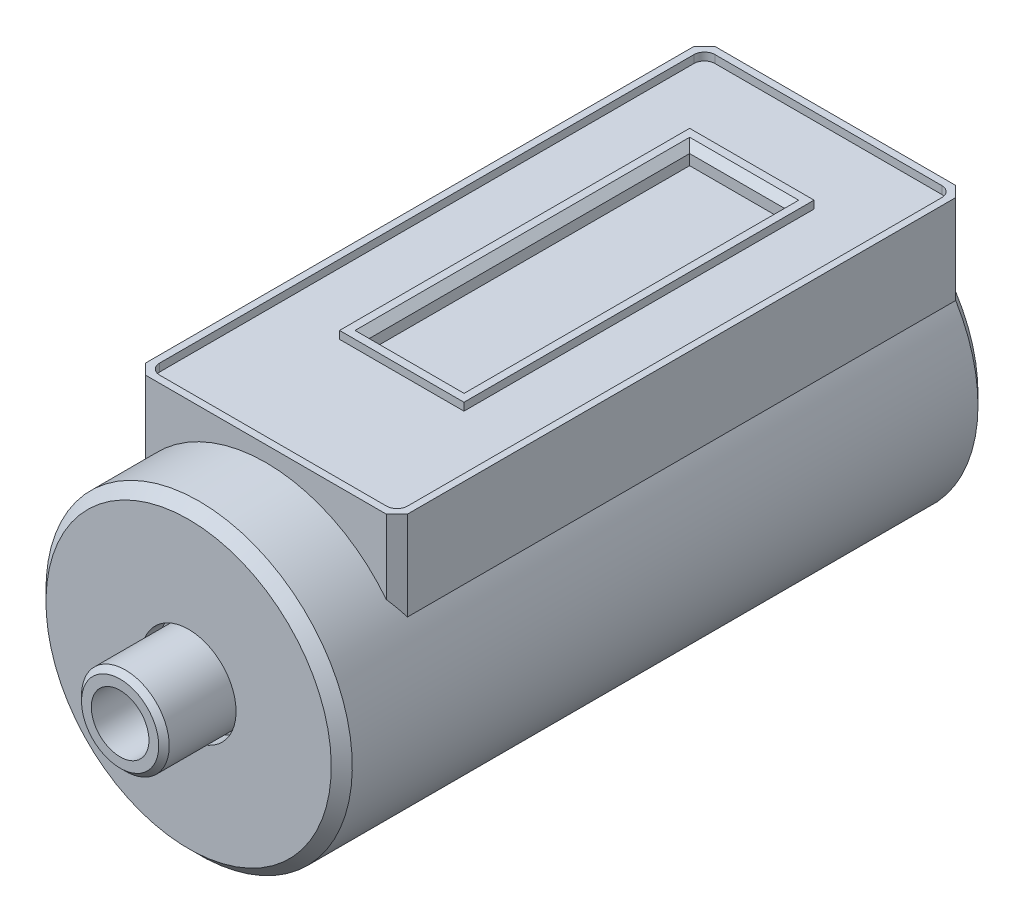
from build123d import *

# Parameters (mm, degrees)
EXTRUDE1_DEPTH     = 12.19
CHAMFER1_SIZE      = 0.76
SKETCH4_W          = 8.99
SKETCH4_H          = 25.3
CUT_EXTRUDE1_DEPTH = 0.56
SKETCH5_W          = 6.86
SKETCH5_H          = 23.16
CUT_EXTRUDE2_DEPTH = 1.27
CHAMFER2_SIZE      = 0.51
HOLE1_D            = 4.1656
HOLE1_DEPTH        = 6.35
HOLE1_TIP          = 1.251472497


with BuildPart() as part:
    # Sketch2 → Revolve1 (revolve)
    with BuildSketch(Plane(origin=(0, 0, 0), x_dir=(0, 0, -1), z_dir=(1, 0, 0))):
        Polygon((46.735, 0), (46.735, 2.79), (47.115, 3.17), (52.955, 3.17), (52.955, 3.43), (51.685, 3.43), (51.685, 10.31), (52.445, 11.07), (98.425, 11.07), (98.425, 0), align=None)
    revolve(axis=Axis((0, 0, -98.425), (0, 0, 1)))

    # Sketch3 → Extrude1 (add)
    with BuildSketch(Plane(origin=(0, 0, 0), x_dir=(1, 0, 0), z_dir=(0, 1, 0))):
        Polygon((-9.46, 98.425), (9.46, 98.425), (9.46, 58.035), (8.7, 57.275), (-8.7, 57.275), (-9.46, 58.035), align=None)
    extrude(amount=EXTRUDE1_DEPTH)

    # Chamfer1
    chamfer1_edges = [part.edges().sort_by_distance(p)[0] for p in [
        (-9.46, 8.969599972, -98.425),
        (9.46, 8.969599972, -98.425),
        (0, -11.07, -98.425),
    ]]
    chamfer(chamfer1_edges, length=CHAMFER1_SIZE)

    # Sketch4 → Cut-Extrude1 (cut)
    with BuildSketch(Plane(origin=(0, 12.19, 0), x_dir=(1, 0, 0), z_dir=(0, 1, 0))):
        with BuildLine():
            Line((-8.19, 97.915), (8.2, 97.915))
            ThreePointArc((8.2, 97.915), (8.737401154, 97.692401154), (8.96, 97.155))
            Line((8.96, 97.155), (8.96, 58.545))
            ThreePointArc((8.96, 58.545), (8.737401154, 58.007598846), (8.2, 57.785))
            Line((8.2, 57.785), (-8.19, 57.785))
            ThreePointArc((-8.19, 57.785), (-8.727401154, 58.007598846), (-8.95, 58.545))
            Line((-8.95, 58.545), (-8.95, 97.155))
            ThreePointArc((-8.95, 97.155), (-8.727401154, 97.692401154), (-8.19, 97.915))
        make_face()
        with Locations((0.005, 79.735)):
            Rectangle(SKETCH4_W, SKETCH4_H, mode=Mode.SUBTRACT)
    extrude(amount=-CUT_EXTRUDE1_DEPTH, mode=Mode.SUBTRACT)

    # Sketch5 → Cut-Extrude2 (cut)
    with BuildSketch(Plane(origin=(0, 12.19, 0), x_dir=(1, 0, 0), z_dir=(0, 1, 0))):
        with Locations((0.01, 79.735)):
            Rectangle(SKETCH5_W, SKETCH5_H)
    extrude(amount=-CUT_EXTRUDE2_DEPTH, mode=Mode.SUBTRACT)

    # Chamfer2
    chamfer2_edges = [part.edges().sort_by_distance(p)[0] for p in [
        (-3.42, 12.19, -79.735),
        (0.01, 12.19, -68.155),
        (3.44, 12.19, -79.735),
        (0.01, 12.19, -91.315),
    ]]
    chamfer(chamfer2_edges, length=CHAMFER2_SIZE)

    # Hole1
    with Locations(Plane.XY.offset(-46.735)):
        with Locations((0, 0)):
            Hole(HOLE1_D / 2, depth=HOLE1_DEPTH)
            with Locations((0, 0, -(HOLE1_DEPTH + HOLE1_TIP / 2))):  # 118° drill point
                Cone(0, HOLE1_D / 2, HOLE1_TIP, mode=Mode.SUBTRACT)


solid = part.part
